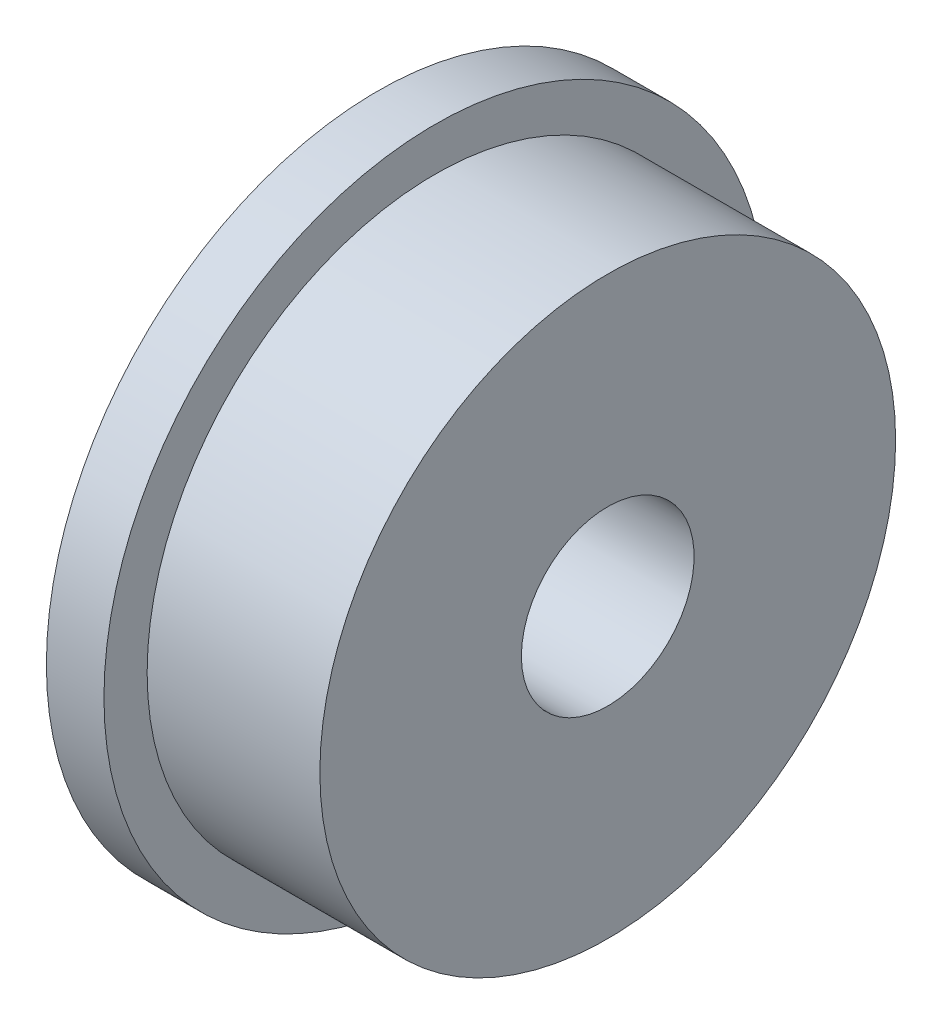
from build123d import *


with BuildPart() as part:
    # Esquisse1 → R_volution1 (revolve)
    with BuildSketch(Plane(origin=(0, 0, 0), x_dir=(1, 0, 0), z_dir=(0, 1, 0)), mode=Mode.PRIVATE) as r_volution1_sk:
        Polygon((0, 1.5), (0, 5.75), (1, 5.75), (1, 5), (4, 5), (4, 1.5), align=None)
    revolve(r_volution1_sk.sketch.rotate(Axis((0, 0, 0), (1, 0, 0)), 180), axis=Axis((0, 0, 0), (1, 0, 0)))


solid = part.part
